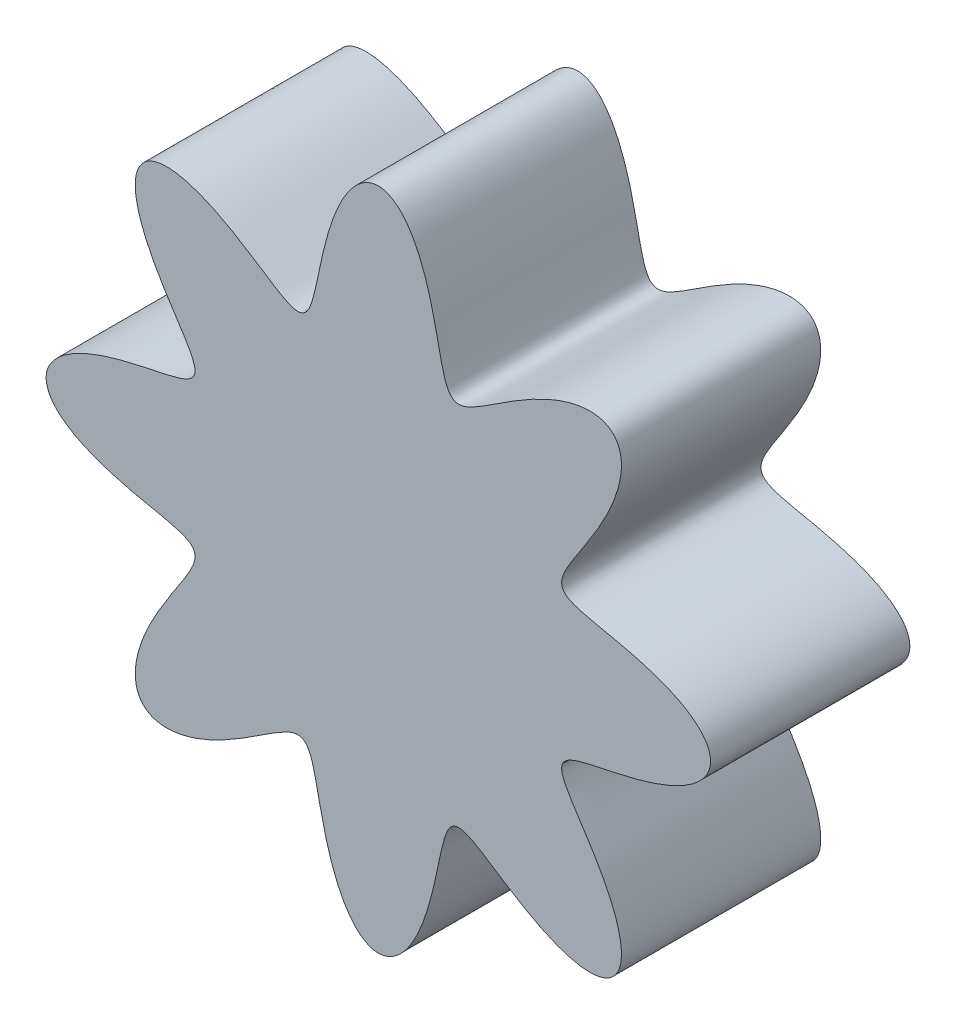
from build123d import *

# Parameters (mm, degrees)
BOSS_EXTRUDE1_DEPTH = 38.1


with BuildPart() as part:
    # Sketch2 → Boss-Extrude1 (new, symmetric)
    with BuildSketch(Plane.XY):
        with BuildLine():
            add(Edge.make_bspline(
                [(127, 0), (127, 0.744327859), (126.812104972, 2.265534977), (125.986272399, 4.487647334), (124.645591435, 6.636822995), (122.825734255, 8.69471257), (120.564985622, 10.646744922), (117.906803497, 12.479599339), (114.901276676, 14.181755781), (111.605029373, 15.744685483), (108.080250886, 17.163805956), (104.393338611, 18.439077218), (100.613380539, 19.575293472), (96.810577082, 20.582132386), (93.054651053, 21.474001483), (89.413276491, 22.2697096), (85.950544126, 22.991979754), (82.725467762, 23.666833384), (79.790498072, 24.322860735), (77.189968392, 24.990571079), (74.958247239, 25.701894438), (73.117742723, 26.491788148), (71.678711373, 27.402192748), (70.655927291, 28.495553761), (70.110684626, 29.811886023), (70.060779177, 31.308226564), (70.43457478, 32.969528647), (71.17746876, 34.829501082), (72.252552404, 36.910547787), (73.619262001, 39.2215425), (75.230717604, 41.76076085), (77.033997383, 44.518427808), (78.971796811, 47.477671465), (80.983986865, 50.615162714), (83.009180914, 53.901650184), (84.986226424, 57.302580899), (86.855634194, 60.778841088), (88.56092188, 64.287634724), (90.049846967, 67.783499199), (91.275487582, 71.219456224), (92.197109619, 74.548290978), (92.780704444, 77.723933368), (92.998999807, 80.702819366), (92.83068552, 83.444800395), (92.258993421, 85.912501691), (91.271674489, 88.067724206), (89.867570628, 89.867570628), (88.067724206, 91.271674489), (85.912501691, 92.258993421), (83.444800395, 92.83068552), (80.702819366, 92.998999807), (77.723933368, 92.780704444), (74.548290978, 92.197109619), (71.219456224, 91.275487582), (67.783499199, 90.049846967), (64.287634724, 88.56092188), (60.778841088, 86.855634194), (57.302580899, 84.986226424), (53.901650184, 83.009180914), (50.615162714, 80.983986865), (47.477671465, 78.971796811), (44.518427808, 77.033997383), (41.76076085, 75.230717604), (39.2215425, 73.619262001), (36.910547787, 72.252552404), (34.829501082, 71.17746876), (32.969528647, 70.43457478), (31.308226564, 70.060779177), (29.811886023, 70.110684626), (28.495553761, 70.655927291), (27.402192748, 71.678711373), (26.491788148, 73.117742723), (25.701894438, 74.958247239), (24.990571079, 77.189968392), (24.322860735, 79.790498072), (23.666833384, 82.725467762), (22.991979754, 85.950544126), (22.2697096, 89.413276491), (21.474001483, 93.054651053), (20.582132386, 96.810577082), (19.575293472, 100.613380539), (18.439077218, 104.393338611), (17.163805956, 108.080250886), (15.744685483, 111.605029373), (14.181755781, 114.901276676), (12.479599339, 117.906803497), (10.646744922, 120.564985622), (8.69471257, 122.825734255), (6.636822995, 124.645591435), (4.487647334, 125.986272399), (2.265534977, 126.812104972), (0, 127.091937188), (-2.265534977, 126.812104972), (-4.487647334, 125.986272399), (-6.636822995, 124.645591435), (-8.69471257, 122.825734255), (-10.646744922, 120.564985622), (-12.479599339, 117.906803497), (-14.181755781, 114.901276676), (-15.744685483, 111.605029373), (-17.163805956, 108.080250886), (-18.439077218, 104.393338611), (-19.575293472, 100.613380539), (-20.582132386, 96.810577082), (-21.474001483, 93.054651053), (-22.2697096, 89.413276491), (-22.991979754, 85.950544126), (-23.666833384, 82.725467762), (-24.322860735, 79.790498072), (-24.990571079, 77.189968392), (-25.701894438, 74.958247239), (-26.491788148, 73.117742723), (-27.402192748, 71.678711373), (-28.495553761, 70.655927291), (-29.811886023, 70.110684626), (-31.308226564, 70.060779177), (-32.969528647, 70.43457478), (-34.829501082, 71.17746876), (-36.910547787, 72.252552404), (-39.2215425, 73.619262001), (-41.76076085, 75.230717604), (-44.518427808, 77.033997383), (-47.477671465, 78.971796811), (-50.615162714, 80.983986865), (-53.901650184, 83.009180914), (-57.302580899, 84.986226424), (-60.778841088, 86.855634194), (-64.287634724, 88.56092188), (-67.783499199, 90.049846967), (-71.219456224, 91.275487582), (-74.548290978, 92.197109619), (-77.723933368, 92.780704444), (-80.702819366, 92.998999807), (-83.444800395, 92.83068552), (-85.912501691, 92.258993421), (-88.067724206, 91.271674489), (-89.867570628, 89.867570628), (-91.271674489, 88.067724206), (-92.258993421, 85.912501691), (-92.83068552, 83.444800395), (-92.998999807, 80.702819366), (-92.780704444, 77.723933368), (-92.197109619, 74.548290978), (-91.275487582, 71.219456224), (-90.049846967, 67.783499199), (-88.56092188, 64.287634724), (-86.855634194, 60.778841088), (-84.986226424, 57.302580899), (-83.009180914, 53.901650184), (-80.983986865, 50.615162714), (-78.971796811, 47.477671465), (-77.033997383, 44.518427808), (-75.230717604, 41.76076085), (-73.619262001, 39.2215425), (-72.252552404, 36.910547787), (-71.17746876, 34.829501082), (-70.43457478, 32.969528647), (-70.060779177, 31.308226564), (-70.110684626, 29.811886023), (-70.655927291, 28.495553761), (-71.678711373, 27.402192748), (-73.117742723, 26.491788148), (-74.958247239, 25.701894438), (-77.189968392, 24.990571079), (-79.790498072, 24.322860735), (-82.725467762, 23.666833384), (-85.950544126, 22.991979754), (-89.413276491, 22.2697096), (-93.054651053, 21.474001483), (-96.810577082, 20.582132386), (-100.613380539, 19.575293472), (-104.393338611, 18.439077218), (-108.080250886, 17.163805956), (-111.605029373, 15.744685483), (-114.901276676, 14.181755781), (-117.906803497, 12.479599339), (-120.564985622, 10.646744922), (-122.825734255, 8.69471257), (-124.645591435, 6.636822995), (-125.986272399, 4.487647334), (-126.812104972, 2.265534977), (-127.091937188, 0), (-126.812104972, -2.265534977), (-125.986272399, -4.487647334), (-124.645591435, -6.636822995), (-122.825734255, -8.69471257), (-120.564985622, -10.646744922), (-117.906803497, -12.479599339), (-114.901276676, -14.181755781), (-111.605029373, -15.744685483), (-108.080250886, -17.163805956), (-104.393338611, -18.439077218), (-100.613380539, -19.575293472), (-96.810577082, -20.582132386), (-93.054651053, -21.474001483), (-89.413276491, -22.2697096), (-85.950544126, -22.991979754), (-82.725467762, -23.666833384), (-79.790498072, -24.322860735), (-77.189968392, -24.990571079), (-74.958247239, -25.701894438), (-73.117742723, -26.491788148), (-71.678711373, -27.402192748), (-70.655927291, -28.495553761), (-70.110684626, -29.811886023), (-70.060779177, -31.308226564), (-70.43457478, -32.969528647), (-71.17746876, -34.829501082), (-72.252552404, -36.910547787), (-73.619262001, -39.2215425), (-75.230717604, -41.76076085), (-77.033997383, -44.518427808), (-78.971796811, -47.477671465), (-80.983986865, -50.615162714), (-83.009180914, -53.901650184), (-84.986226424, -57.302580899), (-86.855634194, -60.778841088), (-88.56092188, -64.287634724), (-90.049846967, -67.783499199), (-91.275487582, -71.219456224), (-92.197109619, -74.548290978), (-92.780704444, -77.723933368), (-92.998999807, -80.702819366), (-92.83068552, -83.444800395), (-92.258993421, -85.912501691), (-91.271674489, -88.067724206), (-89.867570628, -89.867570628), (-88.067724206, -91.271674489), (-85.912501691, -92.258993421), (-83.444800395, -92.83068552), (-80.702819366, -92.998999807), (-77.723933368, -92.780704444), (-74.548290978, -92.197109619), (-71.219456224, -91.275487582), (-67.783499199, -90.049846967), (-64.287634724, -88.56092188), (-60.778841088, -86.855634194), (-57.302580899, -84.986226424), (-53.901650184, -83.009180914), (-50.615162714, -80.983986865), (-47.477671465, -78.971796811), (-44.518427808, -77.033997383), (-41.76076085, -75.230717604), (-39.2215425, -73.619262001), (-36.910547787, -72.252552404), (-34.829501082, -71.17746876), (-32.969528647, -70.43457478), (-31.308226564, -70.060779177), (-29.811886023, -70.110684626), (-28.495553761, -70.655927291), (-27.402192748, -71.678711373), (-26.491788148, -73.117742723), (-25.701894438, -74.958247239), (-24.990571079, -77.189968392), (-24.322860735, -79.790498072), (-23.666833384, -82.725467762), (-22.991979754, -85.950544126), (-22.2697096, -89.413276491), (-21.474001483, -93.054651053), (-20.582132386, -96.810577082), (-19.575293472, -100.613380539), (-18.439077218, -104.393338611), (-17.163805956, -108.080250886), (-15.744685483, -111.605029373), (-14.181755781, -114.901276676), (-12.479599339, -117.906803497), (-10.646744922, -120.564985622), (-8.69471257, -122.825734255), (-6.636822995, -124.645591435), (-4.487647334, -125.986272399), (-2.265534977, -126.812104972), (0, -127.091937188), (2.265534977, -126.812104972), (4.487647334, -125.986272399), (6.636822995, -124.645591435), (8.69471257, -122.825734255), (10.646744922, -120.564985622), (12.479599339, -117.906803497), (14.181755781, -114.901276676), (15.744685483, -111.605029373), (17.163805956, -108.080250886), (18.439077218, -104.393338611), (19.575293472, -100.613380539), (20.582132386, -96.810577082), (21.474001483, -93.054651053), (22.2697096, -89.413276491), (22.991979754, -85.950544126), (23.666833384, -82.725467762), (24.322860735, -79.790498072), (24.990571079, -77.189968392), (25.701894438, -74.958247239), (26.491788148, -73.117742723), (27.402192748, -71.678711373), (28.495553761, -70.655927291), (29.811886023, -70.110684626), (31.308226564, -70.060779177), (32.969528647, -70.43457478), (34.829501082, -71.17746876), (36.910547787, -72.252552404), (39.2215425, -73.619262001), (41.76076085, -75.230717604), (44.518427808, -77.033997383), (47.477671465, -78.971796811), (50.615162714, -80.983986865), (53.901650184, -83.009180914), (57.302580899, -84.986226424), (60.778841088, -86.855634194), (64.287634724, -88.56092188), (67.783499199, -90.049846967), (71.219456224, -91.275487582), (74.548290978, -92.197109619), (77.723933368, -92.780704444), (80.702819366, -92.998999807), (83.444800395, -92.83068552), (85.912501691, -92.258993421), (88.067724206, -91.271674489), (89.867570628, -89.867570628), (91.271674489, -88.067724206), (92.258993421, -85.912501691), (92.83068552, -83.444800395), (92.998999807, -80.702819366), (92.780704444, -77.723933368), (92.197109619, -74.548290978), (91.275487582, -71.219456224), (90.049846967, -67.783499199), (88.56092188, -64.287634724), (86.855634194, -60.778841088), (84.986226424, -57.302580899), (83.009180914, -53.901650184), (80.983986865, -50.615162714), (78.971796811, -47.477671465), (77.033997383, -44.518427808), (75.230717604, -41.76076085), (73.619262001, -39.2215425), (72.252552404, -36.910547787), (71.17746876, -34.829501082), (70.43457478, -32.969528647), (70.060779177, -31.308226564), (70.110684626, -29.811886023), (70.655927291, -28.495553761), (71.678711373, -27.402192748), (73.117742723, -26.491788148), (74.958247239, -25.701894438), (77.189968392, -24.990571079), (79.790498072, -24.322860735), (82.725467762, -23.666833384), (85.950544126, -22.991979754), (89.413276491, -22.2697096), (93.054651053, -21.474001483), (96.810577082, -20.582132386), (100.613380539, -19.575293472), (104.393338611, -18.439077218), (108.080250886, -17.163805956), (111.605029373, -15.744685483), (114.901276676, -14.181755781), (117.906803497, -12.479599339), (120.564985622, -10.646744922), (122.825734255, -8.69471257), (124.645591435, -6.636822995), (125.986272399, -4.487647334), (126.812104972, -2.265534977), (127, -0.744327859), (127, 0)],
                knots=[0, 0, 0, 0, 0.002076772, 0.004244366, 0.006576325, 0.009120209, 0.011897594, 0.014908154, 0.018134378, 0.021545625, 0.025101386, 0.028753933, 0.03245056, 0.036135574, 0.039752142, 0.043244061, 0.046557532, 0.049643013, 0.052457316, 0.054966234, 0.057148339, 0.059001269, 0.060552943, 0.061879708, 0.063120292, 0.064447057, 0.065998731, 0.067851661, 0.070033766, 0.072542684, 0.075356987, 0.078442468, 0.081755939, 0.085247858, 0.088864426, 0.09254944, 0.096246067, 0.099898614, 0.103454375, 0.106865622, 0.110091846, 0.113102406, 0.115879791, 0.118423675, 0.120755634, 0.122923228, 0.125, 0.127076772, 0.129244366, 0.131576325, 0.134120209, 0.136897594, 0.139908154, 0.143134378, 0.146545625, 0.150101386, 0.153753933, 0.15745056, 0.161135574, 0.164752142, 0.168244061, 0.171557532, 0.174643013, 0.177457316, 0.179966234, 0.182148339, 0.184001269, 0.185552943, 0.186879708, 0.188120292, 0.189447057, 0.190998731, 0.192851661, 0.195033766, 0.197542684, 0.200356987, 0.203442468, 0.206755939, 0.210247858, 0.213864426, 0.21754944, 0.221246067, 0.224898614, 0.228454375, 0.231865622, 0.235091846, 0.238102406, 0.240879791, 0.243423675, 0.245755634, 0.247923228, 0.25, 0.252076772, 0.254244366, 0.256576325, 0.259120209, 0.261897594, 0.264908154, 0.268134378, 0.271545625, 0.275101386, 0.278753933, 0.28245056, 0.286135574, 0.289752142, 0.293244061, 0.296557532, 0.299643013, 0.302457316, 0.304966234, 0.307148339, 0.309001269, 0.310552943, 0.311879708, 0.313120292, 0.314447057, 0.315998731, 0.317851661, 0.320033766, 0.322542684, 0.325356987, 0.328442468, 0.331755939, 0.335247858, 0.338864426, 0.34254944, 0.346246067, 0.349898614, 0.353454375, 0.356865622, 0.360091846, 0.363102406, 0.365879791, 0.368423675, 0.370755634, 0.372923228, 0.375, 0.377076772, 0.379244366, 0.381576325, 0.384120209, 0.386897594, 0.389908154, 0.393134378, 0.396545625, 0.400101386, 0.403753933, 0.40745056, 0.411135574, 0.414752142, 0.418244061, 0.421557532, 0.424643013, 0.427457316, 0.429966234, 0.432148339, 0.434001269, 0.435552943, 0.436879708, 0.438120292, 0.439447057, 0.440998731, 0.442851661, 0.445033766, 0.447542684, 0.450356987, 0.453442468, 0.456755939, 0.460247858, 0.463864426, 0.46754944, 0.471246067, 0.474898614, 0.478454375, 0.481865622, 0.485091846, 0.488102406, 0.490879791, 0.493423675, 0.495755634, 0.497923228, 0.5, 0.502076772, 0.504244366, 0.506576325, 0.509120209, 0.511897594, 0.514908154, 0.518134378, 0.521545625, 0.525101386, 0.528753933, 0.53245056, 0.536135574, 0.539752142, 0.543244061, 0.546557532, 0.549643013, 0.552457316, 0.554966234, 0.557148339, 0.559001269, 0.560552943, 0.561879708, 0.563120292, 0.564447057, 0.565998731, 0.567851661, 0.570033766, 0.572542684, 0.575356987, 0.578442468, 0.581755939, 0.585247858, 0.588864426, 0.59254944, 0.596246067, 0.599898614, 0.603454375, 0.606865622, 0.610091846, 0.613102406, 0.615879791, 0.618423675, 0.620755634, 0.622923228, 0.625, 0.627076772, 0.629244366, 0.631576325, 0.634120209, 0.636897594, 0.639908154, 0.643134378, 0.646545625, 0.650101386, 0.653753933, 0.65745056, 0.661135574, 0.664752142, 0.668244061, 0.671557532, 0.674643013, 0.677457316, 0.679966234, 0.682148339, 0.684001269, 0.685552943, 0.686879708, 0.688120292, 0.689447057, 0.690998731, 0.692851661, 0.695033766, 0.697542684, 0.700356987, 0.703442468, 0.706755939, 0.710247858, 0.713864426, 0.71754944, 0.721246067, 0.724898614, 0.728454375, 0.731865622, 0.735091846, 0.738102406, 0.740879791, 0.743423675, 0.745755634, 0.747923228, 0.75, 0.752076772, 0.754244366, 0.756576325, 0.759120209, 0.761897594, 0.764908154, 0.768134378, 0.771545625, 0.775101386, 0.778753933, 0.78245056, 0.786135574, 0.789752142, 0.793244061, 0.796557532, 0.799643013, 0.802457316, 0.804966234, 0.807148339, 0.809001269, 0.810552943, 0.811879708, 0.813120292, 0.814447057, 0.815998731, 0.817851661, 0.820033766, 0.822542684, 0.825356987, 0.828442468, 0.831755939, 0.835247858, 0.838864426, 0.84254944, 0.846246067, 0.849898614, 0.853454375, 0.856865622, 0.860091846, 0.863102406, 0.865879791, 0.868423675, 0.870755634, 0.872923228, 0.875, 0.877076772, 0.879244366, 0.881576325, 0.884120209, 0.886897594, 0.889908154, 0.893134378, 0.896545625, 0.900101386, 0.903753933, 0.90745056, 0.911135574, 0.914752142, 0.918244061, 0.921557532, 0.924643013, 0.927457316, 0.929966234, 0.932148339, 0.934001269, 0.935552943, 0.936879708, 0.938120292, 0.939447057, 0.940998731, 0.942851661, 0.945033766, 0.947542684, 0.950356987, 0.953442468, 0.956755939, 0.960247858, 0.963864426, 0.96754944, 0.971246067, 0.974898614, 0.978454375, 0.981865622, 0.985091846, 0.988102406, 0.990879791, 0.993423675, 0.995755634, 0.997923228, 1, 1, 1, 1], degree=3))
        make_face()
    extrude(amount=BOSS_EXTRUDE1_DEPTH, both=True)


solid = part.part
